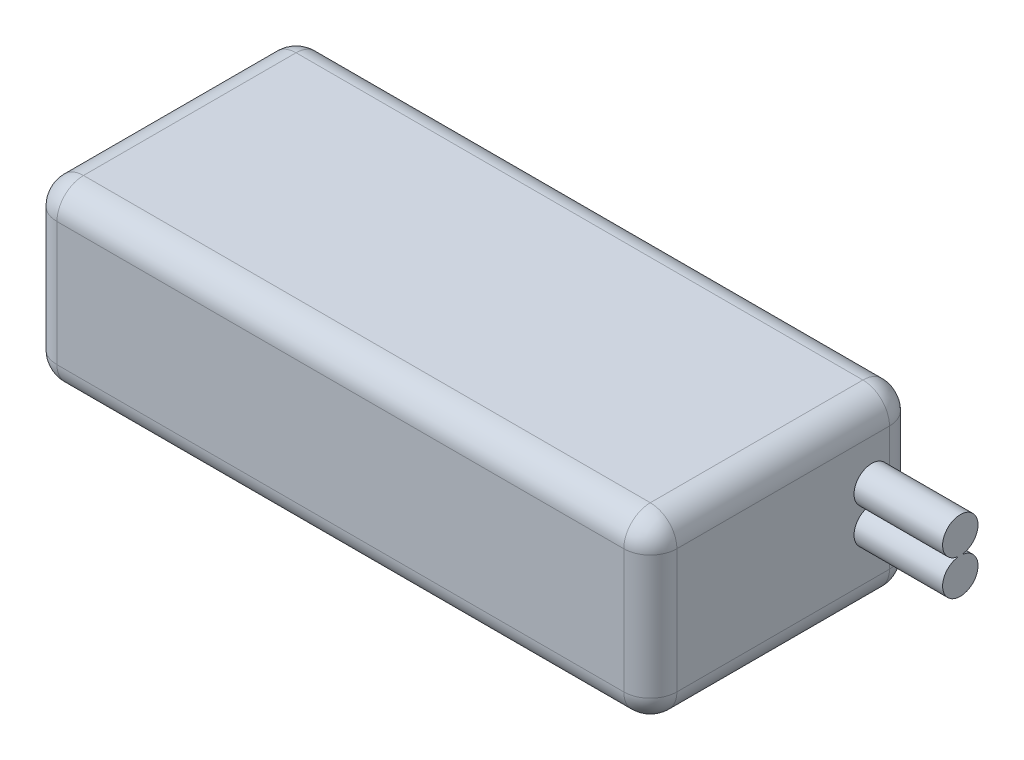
ISO-10303-21;
HEADER;
FILE_DESCRIPTION(('STEP AP214'),'2;1');
FILE_NAME('part.step','',(''),(''),'','','');
FILE_SCHEMA(('AUTOMOTIVE_DESIGN { 1 0 10303 214 1 1 1 1 }'));
ENDSEC;
DATA;
#1=APPLICATION_CONTEXT('core data for automotive mechanical design processes');
#2=APPLICATION_PROTOCOL_DEFINITION('international standard','automotive_design',2000,#1);
#3=PRODUCT_CONTEXT('',#1,'mechanical');
#4=PRODUCT('Part','Part','',(#3));
#5=PRODUCT_RELATED_PRODUCT_CATEGORY('part','',(#4));
#6=PRODUCT_DEFINITION_FORMATION('','',#4);
#7=PRODUCT_DEFINITION_CONTEXT('part definition',#1,'design');
#8=PRODUCT_DEFINITION('design','',#6,#7);
#9=PRODUCT_DEFINITION_SHAPE('','',#8);
#10=(LENGTH_UNIT() NAMED_UNIT(*) SI_UNIT(.MILLI.,.METRE.));
#11=(NAMED_UNIT(*) PLANE_ANGLE_UNIT() SI_UNIT($,.RADIAN.));
#12=(NAMED_UNIT(*) SI_UNIT($,.STERADIAN.) SOLID_ANGLE_UNIT());
#13=UNCERTAINTY_MEASURE_WITH_UNIT(LENGTH_MEASURE(1.E-05),#10,'distance_accuracy_value','');
#14=(GEOMETRIC_REPRESENTATION_CONTEXT(3) GLOBAL_UNCERTAINTY_ASSIGNED_CONTEXT((#13)) GLOBAL_UNIT_ASSIGNED_CONTEXT((#10,
#11,#12)) REPRESENTATION_CONTEXT('',''));
#15=CARTESIAN_POINT('',(0.,0.,0.));
#16=DIRECTION('',(0.,0.,1.));
#17=DIRECTION('',(1.,0.,0.));
#18=AXIS2_PLACEMENT_3D('',#15,#16,#17);
#19=CARTESIAN_POINT('',(70.,20.,0.));
#20=DIRECTION('',(-1.,0.,0.));
#21=DIRECTION('',(0.,0.,1.));
#22=AXIS2_PLACEMENT_3D('',#19,#20,#21);
#23=PLANE('',#22);
#24=CARTESIAN_POINT('',(70.,8.34085297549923,-25.));
#25=DIRECTION('',(1.,0.,0.));
#26=DIRECTION('',(0.,0.,-1.));
#27=AXIS2_PLACEMENT_3D('',#24,#25,#26);
#28=CIRCLE('',#27,2.);
#29=CARTESIAN_POINT('',(70.,10.3147545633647,-24.6779557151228));
#30=VERTEX_POINT('',#29);
#31=CARTESIAN_POINT('',(70.,8.34085297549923,-27.));
#32=VERTEX_POINT('',#31);
#33=EDGE_CURVE('E434',#30,#32,#28,.T.);
#34=ORIENTED_EDGE('',*,*,#33,.F.);
#35=DIRECTION('',(0.,-1.,0.));
#36=VECTOR('',#35,1.);
#37=CARTESIAN_POINT('',(70.,10.3669513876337,-24.6779557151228));
#38=LINE('',#37,#36);
#39=CARTESIAN_POINT('',(70.,10.3669513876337,-24.6779557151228));
#40=VERTEX_POINT('',#39);
#41=EDGE_CURVE('E187',#40,#30,#38,.T.);
#42=ORIENTED_EDGE('',*,*,#41,.F.);
#43=CARTESIAN_POINT('',(70.,12.3408529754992,-25.));
#44=DIRECTION('',(1.,0.,0.));
#45=DIRECTION('',(0.,0.,-1.));
#46=AXIS2_PLACEMENT_3D('',#43,#44,#45);
#47=CIRCLE('',#46,2.);
#48=CARTESIAN_POINT('',(70.,12.3408529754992,-27.));
#49=VERTEX_POINT('',#48);
#50=EDGE_CURVE('E414',#49,#40,#47,.T.);
#51=ORIENTED_EDGE('',*,*,#50,.F.);
#52=DIRECTION('',(0.,-1.,0.));
#53=VECTOR('',#52,1.);
#54=CARTESIAN_POINT('',(70.,20.,-27.));
#55=LINE('',#54,#53);
#56=CARTESIAN_POINT('',(70.,17.,-27.));
#57=VERTEX_POINT('',#56);
#58=EDGE_CURVE('E232',#49,#57,#55,.F.);
#59=ORIENTED_EDGE('',*,*,#58,.T.);
#60=DIRECTION('',(0.,0.,-1.));
#61=VECTOR('',#60,1.);
#62=CARTESIAN_POINT('',(70.,17.,0.));
#63=LINE('',#62,#61);
#64=CARTESIAN_POINT('',(70.,17.,-3.));
#65=VERTEX_POINT('',#64);
#66=EDGE_CURVE('E229',#57,#65,#63,.F.);
#67=ORIENTED_EDGE('',*,*,#66,.T.);
#68=DIRECTION('',(0.,-1.,0.));
#69=VECTOR('',#68,1.);
#70=CARTESIAN_POINT('',(70.,20.,-3.));
#71=LINE('',#70,#69);
#72=CARTESIAN_POINT('',(70.,3.,-3.));
#73=VERTEX_POINT('',#72);
#74=EDGE_CURVE('E241',#65,#73,#71,.T.);
#75=ORIENTED_EDGE('',*,*,#74,.T.);
#76=DIRECTION('',(0.,0.,-1.));
#77=VECTOR('',#76,1.);
#78=CARTESIAN_POINT('',(70.,3.,-30.));
#79=LINE('',#78,#77);
#80=CARTESIAN_POINT('',(70.,3.,-27.));
#81=VERTEX_POINT('',#80);
#82=EDGE_CURVE('E237',#73,#81,#79,.T.);
#83=ORIENTED_EDGE('',*,*,#82,.T.);
#84=EDGE_CURVE('E233',#81,#32,#55,.F.);
#85=ORIENTED_EDGE('',*,*,#84,.T.);
#86=EDGE_LOOP('',(#34,#42,#51,#59,#67,#75,#83,#85));
#87=FACE_BOUND('',#86,.T.);
#88=ADVANCED_FACE('F45',(#87),#23,.F.);
#89=CARTESIAN_POINT('',(70.,10.3147545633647,-25.3220442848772));
#90=VERTEX_POINT('',#89);
#91=EDGE_CURVE('E191',#32,#90,#28,.T.);
#92=ORIENTED_EDGE('',*,*,#91,.F.);
#93=EDGE_CURVE('E238',#32,#49,#55,.F.);
#94=ORIENTED_EDGE('',*,*,#93,.T.);
#95=CARTESIAN_POINT('',(70.,10.3669513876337,-25.3220442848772));
#96=VERTEX_POINT('',#95);
#97=EDGE_CURVE('E68',#96,#49,#47,.T.);
#98=ORIENTED_EDGE('',*,*,#97,.F.);
#99=DIRECTION('',(0.,1.,0.));
#100=VECTOR('',#99,1.);
#101=CARTESIAN_POINT('',(70.,10.3669513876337,-25.3220442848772));
#102=LINE('',#101,#100);
#103=EDGE_CURVE('E63',#90,#96,#102,.T.);
#104=ORIENTED_EDGE('',*,*,#103,.F.);
#105=EDGE_LOOP('',(#92,#94,#98,#104));
#106=FACE_BOUND('',#105,.T.);
#107=ADVANCED_FACE('F409',(#106),#23,.F.);
#108=CARTESIAN_POINT('',(0.,20.,0.));
#109=DIRECTION('',(1.,0.,0.));
#110=DIRECTION('',(0.,0.,-1.));
#111=AXIS2_PLACEMENT_3D('',#108,#109,#110);
#112=PLANE('',#111);
#113=DIRECTION('',(0.,-1.,0.));
#114=VECTOR('',#113,1.);
#115=CARTESIAN_POINT('',(0.,20.,-27.));
#116=LINE('',#115,#114);
#117=CARTESIAN_POINT('',(0.,17.,-27.));
#118=VERTEX_POINT('',#117);
#119=CARTESIAN_POINT('',(0.,3.,-27.));
#120=VERTEX_POINT('',#119);
#121=EDGE_CURVE('E219',#118,#120,#116,.T.);
#122=ORIENTED_EDGE('',*,*,#121,.T.);
#123=DIRECTION('',(0.,0.,1.));
#124=VECTOR('',#123,1.);
#125=CARTESIAN_POINT('',(0.,3.,0.));
#126=LINE('',#125,#124);
#127=CARTESIAN_POINT('',(0.,3.,-3.));
#128=VERTEX_POINT('',#127);
#129=EDGE_CURVE('E226',#120,#128,#126,.T.);
#130=ORIENTED_EDGE('',*,*,#129,.T.);
#131=DIRECTION('',(0.,-1.,0.));
#132=VECTOR('',#131,1.);
#133=CARTESIAN_POINT('',(0.,20.,-3.));
#134=LINE('',#133,#132);
#135=CARTESIAN_POINT('',(0.,17.,-3.));
#136=VERTEX_POINT('',#135);
#137=EDGE_CURVE('E222',#128,#136,#134,.F.);
#138=ORIENTED_EDGE('',*,*,#137,.T.);
#139=DIRECTION('',(0.,0.,1.));
#140=VECTOR('',#139,1.);
#141=CARTESIAN_POINT('',(0.,17.,0.));
#142=LINE('',#141,#140);
#143=EDGE_CURVE('E216',#136,#118,#142,.F.);
#144=ORIENTED_EDGE('',*,*,#143,.T.);
#145=EDGE_LOOP('',(#122,#130,#138,#144));
#146=FACE_BOUND('',#145,.T.);
#147=ADVANCED_FACE('F452',(#146),#112,.F.);
#148=CARTESIAN_POINT('',(0.,20.,0.));
#149=DIRECTION('',(0.,0.,-1.));
#150=DIRECTION('',(-1.,0.,0.));
#151=AXIS2_PLACEMENT_3D('',#148,#149,#150);
#152=PLANE('',#151);
#153=DIRECTION('',(0.,-1.,0.));
#154=VECTOR('',#153,1.);
#155=CARTESIAN_POINT('',(3.,20.,0.));
#156=LINE('',#155,#154);
#157=CARTESIAN_POINT('',(3.,17.,0.));
#158=VERTEX_POINT('',#157);
#159=CARTESIAN_POINT('',(3.,3.,0.));
#160=VERTEX_POINT('',#159);
#161=EDGE_CURVE('E209',#158,#160,#156,.T.);
#162=ORIENTED_EDGE('',*,*,#161,.T.);
#163=DIRECTION('',(1.,0.,0.));
#164=VECTOR('',#163,1.);
#165=CARTESIAN_POINT('',(70.,3.,0.));
#166=LINE('',#165,#164);
#167=CARTESIAN_POINT('',(67.,3.,0.));
#168=VERTEX_POINT('',#167);
#169=EDGE_CURVE('E213',#160,#168,#166,.T.);
#170=ORIENTED_EDGE('',*,*,#169,.T.);
#171=DIRECTION('',(0.,-1.,0.));
#172=VECTOR('',#171,1.);
#173=CARTESIAN_POINT('',(67.,20.,0.));
#174=LINE('',#173,#172);
#175=CARTESIAN_POINT('',(67.,17.,0.));
#176=VERTEX_POINT('',#175);
#177=EDGE_CURVE('E206',#168,#176,#174,.F.);
#178=ORIENTED_EDGE('',*,*,#177,.T.);
#179=DIRECTION('',(1.,0.,0.));
#180=VECTOR('',#179,1.);
#181=CARTESIAN_POINT('',(0.,17.,0.));
#182=LINE('',#181,#180);
#183=EDGE_CURVE('E203',#176,#158,#182,.F.);
#184=ORIENTED_EDGE('',*,*,#183,.T.);
#185=EDGE_LOOP('',(#162,#170,#178,#184));
#186=FACE_BOUND('',#185,.T.);
#187=ADVANCED_FACE('F457',(#186),#152,.F.);
#188=CARTESIAN_POINT('',(0.,20.,-30.));
#189=DIRECTION('',(0.,0.,1.));
#190=DIRECTION('',(1.,0.,0.));
#191=AXIS2_PLACEMENT_3D('',#188,#189,#190);
#192=PLANE('',#191);
#193=DIRECTION('',(-1.,0.,0.));
#194=VECTOR('',#193,1.);
#195=CARTESIAN_POINT('',(0.,17.,-30.));
#196=LINE('',#195,#194);
#197=CARTESIAN_POINT('',(2.99999999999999,17.,-30.));
#198=VERTEX_POINT('',#197);
#199=CARTESIAN_POINT('',(67.,17.,-30.));
#200=VERTEX_POINT('',#199);
#201=EDGE_CURVE('E258',#198,#200,#196,.F.);
#202=ORIENTED_EDGE('',*,*,#201,.T.);
#203=DIRECTION('',(0.,-1.,0.));
#204=VECTOR('',#203,1.);
#205=CARTESIAN_POINT('',(67.,20.,-30.));
#206=LINE('',#205,#204);
#207=CARTESIAN_POINT('',(67.,3.,-30.));
#208=VERTEX_POINT('',#207);
#209=EDGE_CURVE('E267',#200,#208,#206,.T.);
#210=ORIENTED_EDGE('',*,*,#209,.T.);
#211=DIRECTION('',(-1.,0.,0.));
#212=VECTOR('',#211,1.);
#213=CARTESIAN_POINT('',(0.,3.,-30.));
#214=LINE('',#213,#212);
#215=CARTESIAN_POINT('',(2.99999999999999,3.,-30.));
#216=VERTEX_POINT('',#215);
#217=EDGE_CURVE('E264',#208,#216,#214,.T.);
#218=ORIENTED_EDGE('',*,*,#217,.T.);
#219=DIRECTION('',(0.,-1.,0.));
#220=VECTOR('',#219,1.);
#221=CARTESIAN_POINT('',(2.99999999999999,20.,-30.));
#222=LINE('',#221,#220);
#223=EDGE_CURVE('E261',#216,#198,#222,.F.);
#224=ORIENTED_EDGE('',*,*,#223,.T.);
#225=EDGE_LOOP('',(#202,#210,#218,#224));
#226=FACE_BOUND('',#225,.T.);
#227=ADVANCED_FACE('F455',(#226),#192,.F.);
#228=CARTESIAN_POINT('',(0.,20.,0.));
#229=DIRECTION('',(0.,-1.,0.));
#230=DIRECTION('',(0.,0.,-1.));
#231=AXIS2_PLACEMENT_3D('',#228,#229,#230);
#232=PLANE('',#231);
#233=DIRECTION('',(-1.,0.,0.));
#234=VECTOR('',#233,1.);
#235=CARTESIAN_POINT('',(0.,20.,-27.));
#236=LINE('',#235,#234);
#237=CARTESIAN_POINT('',(67.,20.,-27.));
#238=VERTEX_POINT('',#237);
#239=CARTESIAN_POINT('',(2.99999999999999,20.,-27.));
#240=VERTEX_POINT('',#239);
#241=EDGE_CURVE('E55',#238,#240,#236,.T.);
#242=ORIENTED_EDGE('',*,*,#241,.T.);
#243=DIRECTION('',(0.,0.,1.));
#244=VECTOR('',#243,1.);
#245=CARTESIAN_POINT('',(3.,20.,0.));
#246=LINE('',#245,#244);
#247=CARTESIAN_POINT('',(3.,20.,-3.));
#248=VERTEX_POINT('',#247);
#249=EDGE_CURVE('E11',#240,#248,#246,.T.);
#250=ORIENTED_EDGE('',*,*,#249,.T.);
#251=DIRECTION('',(1.,0.,0.));
#252=VECTOR('',#251,1.);
#253=CARTESIAN_POINT('',(0.,20.,-3.));
#254=LINE('',#253,#252);
#255=CARTESIAN_POINT('',(67.,20.,-3.));
#256=VERTEX_POINT('',#255);
#257=EDGE_CURVE('E271',#248,#256,#254,.T.);
#258=ORIENTED_EDGE('',*,*,#257,.T.);
#259=DIRECTION('',(0.,0.,-1.));
#260=VECTOR('',#259,1.);
#261=CARTESIAN_POINT('',(67.,20.,0.));
#262=LINE('',#261,#260);
#263=EDGE_CURVE('E274',#256,#238,#262,.T.);
#264=ORIENTED_EDGE('',*,*,#263,.T.);
#265=EDGE_LOOP('',(#242,#250,#258,#264));
#266=FACE_BOUND('',#265,.T.);
#267=ADVANCED_FACE('F383',(#266),#232,.F.);
#268=CARTESIAN_POINT('',(0.,0.,0.));
#269=DIRECTION('',(0.,-1.,0.));
#270=DIRECTION('',(0.,0.,-1.));
#271=AXIS2_PLACEMENT_3D('',#268,#269,#270);
#272=PLANE('',#271);
#273=DIRECTION('',(0.,0.,-1.));
#274=VECTOR('',#273,1.);
#275=CARTESIAN_POINT('',(67.,0.,0.));
#276=LINE('',#275,#274);
#277=CARTESIAN_POINT('',(67.,0.,-27.));
#278=VERTEX_POINT('',#277);
#279=CARTESIAN_POINT('',(67.,0.,-3.));
#280=VERTEX_POINT('',#279);
#281=EDGE_CURVE('E251',#278,#280,#276,.F.);
#282=ORIENTED_EDGE('',*,*,#281,.T.);
#283=DIRECTION('',(1.,0.,0.));
#284=VECTOR('',#283,1.);
#285=CARTESIAN_POINT('',(0.,0.,-3.));
#286=LINE('',#285,#284);
#287=CARTESIAN_POINT('',(3.,0.,-3.));
#288=VERTEX_POINT('',#287);
#289=EDGE_CURVE('E254',#280,#288,#286,.F.);
#290=ORIENTED_EDGE('',*,*,#289,.T.);
#291=DIRECTION('',(0.,0.,1.));
#292=VECTOR('',#291,1.);
#293=CARTESIAN_POINT('',(2.99999999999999,0.,-30.));
#294=LINE('',#293,#292);
#295=CARTESIAN_POINT('',(2.99999999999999,0.,-27.));
#296=VERTEX_POINT('',#295);
#297=EDGE_CURVE('E245',#288,#296,#294,.F.);
#298=ORIENTED_EDGE('',*,*,#297,.T.);
#299=DIRECTION('',(-1.,0.,0.));
#300=VECTOR('',#299,1.);
#301=CARTESIAN_POINT('',(70.,0.,-27.));
#302=LINE('',#301,#300);
#303=EDGE_CURVE('E248',#296,#278,#302,.F.);
#304=ORIENTED_EDGE('',*,*,#303,.T.);
#305=EDGE_LOOP('',(#282,#290,#298,#304));
#306=FACE_BOUND('',#305,.T.);
#307=ADVANCED_FACE('F529',(#306),#272,.T.);
#308=CARTESIAN_POINT('',(67.,20.,-27.));
#309=DIRECTION('',(0.,-1.,0.));
#310=DIRECTION('',(0.,0.,-1.));
#311=AXIS2_PLACEMENT_3D('',#308,#309,#310);
#312=CYLINDRICAL_SURFACE('',#311,3.);
#313=CARTESIAN_POINT('',(67.,17.,-27.));
#314=DIRECTION('',(0.,1.,0.));
#315=DIRECTION('',(0.,0.,1.));
#316=AXIS2_PLACEMENT_3D('',#313,#314,#315);
#317=CIRCLE('',#316,3.);
#318=EDGE_CURVE('E49',#57,#200,#317,.T.);
#319=ORIENTED_EDGE('',*,*,#318,.F.);
#320=ORIENTED_EDGE('',*,*,#58,.F.);
#321=ORIENTED_EDGE('',*,*,#93,.F.);
#322=ORIENTED_EDGE('',*,*,#84,.F.);
#323=CARTESIAN_POINT('',(67.,3.,-27.));
#324=DIRECTION('',(0.,-1.,0.));
#325=DIRECTION('',(0.,0.,-1.));
#326=AXIS2_PLACEMENT_3D('',#323,#324,#325);
#327=CIRCLE('',#326,3.);
#328=EDGE_CURVE('E357',#208,#81,#327,.T.);
#329=ORIENTED_EDGE('',*,*,#328,.F.);
#330=ORIENTED_EDGE('',*,*,#209,.F.);
#331=EDGE_LOOP('',(#319,#320,#321,#322,#329,#330));
#332=FACE_BOUND('',#331,.T.);
#333=ADVANCED_FACE('F47',(#332),#312,.T.);
#334=CARTESIAN_POINT('',(67.,17.,-27.));
#335=DIRECTION('',(0.,0.,-1.));
#336=DIRECTION('',(-1.,0.,0.));
#337=AXIS2_PLACEMENT_3D('',#334,#335,#336);
#338=SPHERICAL_SURFACE('',#337,3.);
#339=CARTESIAN_POINT('',(67.,17.,-27.));
#340=DIRECTION('',(0.,0.,-1.));
#341=DIRECTION('',(-1.,0.,0.));
#342=AXIS2_PLACEMENT_3D('',#339,#340,#341);
#343=CIRCLE('',#342,3.);
#344=EDGE_CURVE('E350',#57,#238,#343,.F.);
#345=ORIENTED_EDGE('',*,*,#344,.F.);
#346=ORIENTED_EDGE('',*,*,#318,.T.);
#347=CARTESIAN_POINT('',(67.,17.,-27.));
#348=DIRECTION('',(1.,0.,0.));
#349=DIRECTION('',(0.,0.,-1.));
#350=AXIS2_PLACEMENT_3D('',#347,#348,#349);
#351=CIRCLE('',#350,3.);
#352=EDGE_CURVE('E354',#238,#200,#351,.F.);
#353=ORIENTED_EDGE('',*,*,#352,.F.);
#354=EDGE_LOOP('',(#345,#346,#353));
#355=FACE_BOUND('',#354,.T.);
#356=ADVANCED_FACE('F370',(#355),#338,.T.);
#357=CARTESIAN_POINT('',(67.,3.,-27.));
#358=DIRECTION('',(1.,0.,0.));
#359=DIRECTION('',(0.,1.,0.));
#360=AXIS2_PLACEMENT_3D('',#357,#358,#359);
#361=SPHERICAL_SURFACE('',#360,3.);
#362=CARTESIAN_POINT('',(67.,3.,-27.));
#363=DIRECTION('',(1.,0.,0.));
#364=DIRECTION('',(0.,0.,-1.));
#365=AXIS2_PLACEMENT_3D('',#362,#363,#364);
#366=CIRCLE('',#365,3.);
#367=EDGE_CURVE('E342',#208,#278,#366,.F.);
#368=ORIENTED_EDGE('',*,*,#367,.F.);
#369=ORIENTED_EDGE('',*,*,#328,.T.);
#370=CARTESIAN_POINT('',(67.,3.,-27.));
#371=DIRECTION('',(0.,0.,-1.));
#372=DIRECTION('',(-1.,0.,0.));
#373=AXIS2_PLACEMENT_3D('',#370,#371,#372);
#374=CIRCLE('',#373,3.);
#375=EDGE_CURVE('E346',#278,#81,#374,.F.);
#376=ORIENTED_EDGE('',*,*,#375,.F.);
#377=EDGE_LOOP('',(#368,#369,#376));
#378=FACE_BOUND('',#377,.T.);
#379=ADVANCED_FACE('F522',(#378),#361,.T.);
#380=CARTESIAN_POINT('',(0.,17.,-27.));
#381=DIRECTION('',(-1.,0.,0.));
#382=DIRECTION('',(0.,0.,1.));
#383=AXIS2_PLACEMENT_3D('',#380,#381,#382);
#384=CYLINDRICAL_SURFACE('',#383,3.);
#385=ORIENTED_EDGE('',*,*,#352,.T.);
#386=ORIENTED_EDGE('',*,*,#201,.F.);
#387=CARTESIAN_POINT('',(2.99999999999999,17.,-27.));
#388=DIRECTION('',(-1.,0.,0.));
#389=DIRECTION('',(0.,0.,1.));
#390=AXIS2_PLACEMENT_3D('',#387,#388,#389);
#391=CIRCLE('',#390,3.);
#392=EDGE_CURVE('E334',#240,#198,#391,.T.);
#393=ORIENTED_EDGE('',*,*,#392,.F.);
#394=ORIENTED_EDGE('',*,*,#241,.F.);
#395=EDGE_LOOP('',(#385,#386,#393,#394));
#396=FACE_BOUND('',#395,.T.);
#397=ADVANCED_FACE('F378',(#396),#384,.T.);
#398=CARTESIAN_POINT('',(67.,17.,0.));
#399=DIRECTION('',(0.,0.,-1.));
#400=DIRECTION('',(-1.,0.,0.));
#401=AXIS2_PLACEMENT_3D('',#398,#399,#400);
#402=CYLINDRICAL_SURFACE('',#401,3.);
#403=ORIENTED_EDGE('',*,*,#344,.T.);
#404=ORIENTED_EDGE('',*,*,#263,.F.);
#405=CARTESIAN_POINT('',(67.,17.,-3.));
#406=DIRECTION('',(0.,0.,1.));
#407=DIRECTION('',(1.,0.,0.));
#408=AXIS2_PLACEMENT_3D('',#405,#406,#407);
#409=CIRCLE('',#408,3.);
#410=EDGE_CURVE('E330',#65,#256,#409,.T.);
#411=ORIENTED_EDGE('',*,*,#410,.F.);
#412=ORIENTED_EDGE('',*,*,#66,.F.);
#413=EDGE_LOOP('',(#403,#404,#411,#412));
#414=FACE_BOUND('',#413,.T.);
#415=ADVANCED_FACE('F389',(#414),#402,.T.);
#416=CARTESIAN_POINT('',(67.,20.,-3.));
#417=DIRECTION('',(0.,-1.,0.));
#418=DIRECTION('',(0.,0.,-1.));
#419=AXIS2_PLACEMENT_3D('',#416,#417,#418);
#420=CYLINDRICAL_SURFACE('',#419,3.);
#421=CARTESIAN_POINT('',(67.,3.,-3.));
#422=DIRECTION('',(0.,-1.,0.));
#423=DIRECTION('',(0.,0.,-1.));
#424=AXIS2_PLACEMENT_3D('',#421,#422,#423);
#425=CIRCLE('',#424,3.);
#426=EDGE_CURVE('E322',#73,#168,#425,.T.);
#427=ORIENTED_EDGE('',*,*,#426,.F.);
#428=ORIENTED_EDGE('',*,*,#74,.F.);
#429=CARTESIAN_POINT('',(67.,17.,-3.));
#430=DIRECTION('',(0.,1.,0.));
#431=DIRECTION('',(0.,0.,1.));
#432=AXIS2_PLACEMENT_3D('',#429,#430,#431);
#433=CIRCLE('',#432,3.);
#434=EDGE_CURVE('E326',#176,#65,#433,.T.);
#435=ORIENTED_EDGE('',*,*,#434,.F.);
#436=ORIENTED_EDGE('',*,*,#177,.F.);
#437=EDGE_LOOP('',(#427,#428,#435,#436));
#438=FACE_BOUND('',#437,.T.);
#439=ADVANCED_FACE('F395',(#438),#420,.T.);
#440=CARTESIAN_POINT('',(67.,3.,0.));
#441=DIRECTION('',(0.,0.,1.));
#442=DIRECTION('',(1.,0.,0.));
#443=AXIS2_PLACEMENT_3D('',#440,#441,#442);
#444=CYLINDRICAL_SURFACE('',#443,3.);
#445=ORIENTED_EDGE('',*,*,#375,.T.);
#446=ORIENTED_EDGE('',*,*,#82,.F.);
#447=CARTESIAN_POINT('',(67.,3.,-3.));
#448=DIRECTION('',(0.,0.,1.));
#449=DIRECTION('',(1.,0.,0.));
#450=AXIS2_PLACEMENT_3D('',#447,#448,#449);
#451=CIRCLE('',#450,3.);
#452=EDGE_CURVE('E319',#280,#73,#451,.T.);
#453=ORIENTED_EDGE('',*,*,#452,.F.);
#454=ORIENTED_EDGE('',*,*,#281,.F.);
#455=EDGE_LOOP('',(#445,#446,#453,#454));
#456=FACE_BOUND('',#455,.T.);
#457=ADVANCED_FACE('F403',(#456),#444,.T.);
#458=CARTESIAN_POINT('',(0.,3.,-27.));
#459=DIRECTION('',(1.,0.,0.));
#460=DIRECTION('',(0.,0.,-1.));
#461=AXIS2_PLACEMENT_3D('',#458,#459,#460);
#462=CYLINDRICAL_SURFACE('',#461,3.);
#463=ORIENTED_EDGE('',*,*,#367,.T.);
#464=ORIENTED_EDGE('',*,*,#303,.F.);
#465=CARTESIAN_POINT('',(2.99999999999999,3.,-27.));
#466=DIRECTION('',(-1.,0.,0.));
#467=DIRECTION('',(0.,0.,1.));
#468=AXIS2_PLACEMENT_3D('',#465,#466,#467);
#469=CIRCLE('',#468,3.);
#470=EDGE_CURVE('E315',#216,#296,#469,.T.);
#471=ORIENTED_EDGE('',*,*,#470,.F.);
#472=ORIENTED_EDGE('',*,*,#217,.F.);
#473=EDGE_LOOP('',(#463,#464,#471,#472));
#474=FACE_BOUND('',#473,.T.);
#475=ADVANCED_FACE('F509',(#474),#462,.T.);
#476=CARTESIAN_POINT('',(2.99999999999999,20.,-27.));
#477=DIRECTION('',(0.,-1.,0.));
#478=DIRECTION('',(0.,0.,-1.));
#479=AXIS2_PLACEMENT_3D('',#476,#477,#478);
#480=CYLINDRICAL_SURFACE('',#479,3.);
#481=CARTESIAN_POINT('',(2.99999999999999,17.,-27.));
#482=DIRECTION('',(0.,1.,0.));
#483=DIRECTION('',(0.,0.,1.));
#484=AXIS2_PLACEMENT_3D('',#481,#482,#483);
#485=CIRCLE('',#484,3.);
#486=EDGE_CURVE('E338',#198,#118,#485,.T.);
#487=ORIENTED_EDGE('',*,*,#486,.F.);
#488=ORIENTED_EDGE('',*,*,#223,.F.);
#489=CARTESIAN_POINT('',(2.99999999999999,3.,-27.));
#490=DIRECTION('',(0.,-1.,0.));
#491=DIRECTION('',(0.,0.,-1.));
#492=AXIS2_PLACEMENT_3D('',#489,#490,#491);
#493=CIRCLE('',#492,3.);
#494=EDGE_CURVE('E311',#120,#216,#493,.T.);
#495=ORIENTED_EDGE('',*,*,#494,.F.);
#496=ORIENTED_EDGE('',*,*,#121,.F.);
#497=EDGE_LOOP('',(#487,#488,#495,#496));
#498=FACE_BOUND('',#497,.T.);
#499=ADVANCED_FACE('F505',(#498),#480,.T.);
#500=CARTESIAN_POINT('',(2.99999999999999,17.,-27.));
#501=DIRECTION('',(0.,0.,-1.));
#502=DIRECTION('',(-1.,0.,0.));
#503=AXIS2_PLACEMENT_3D('',#500,#501,#502);
#504=SPHERICAL_SURFACE('',#503,3.);
#505=ORIENTED_EDGE('',*,*,#392,.T.);
#506=ORIENTED_EDGE('',*,*,#486,.T.);
#507=CARTESIAN_POINT('',(2.99999999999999,17.,-27.));
#508=DIRECTION('',(0.,0.,-1.));
#509=DIRECTION('',(-1.,0.,0.));
#510=AXIS2_PLACEMENT_3D('',#507,#508,#509);
#511=CIRCLE('',#510,3.);
#512=EDGE_CURVE('E307',#240,#118,#511,.F.);
#513=ORIENTED_EDGE('',*,*,#512,.F.);
#514=EDGE_LOOP('',(#505,#506,#513));
#515=FACE_BOUND('',#514,.T.);
#516=ADVANCED_FACE('F501',(#515),#504,.T.);
#517=CARTESIAN_POINT('',(67.,17.,-3.));
#518=DIRECTION('',(1.,0.,0.));
#519=DIRECTION('',(0.,0.,-1.));
#520=AXIS2_PLACEMENT_3D('',#517,#518,#519);
#521=SPHERICAL_SURFACE('',#520,3.);
#522=ORIENTED_EDGE('',*,*,#434,.T.);
#523=ORIENTED_EDGE('',*,*,#410,.T.);
#524=CARTESIAN_POINT('',(67.,17.,-3.));
#525=DIRECTION('',(1.,0.,0.));
#526=DIRECTION('',(0.,0.,-1.));
#527=AXIS2_PLACEMENT_3D('',#524,#525,#526);
#528=CIRCLE('',#527,3.);
#529=EDGE_CURVE('E303',#176,#256,#528,.F.);
#530=ORIENTED_EDGE('',*,*,#529,.F.);
#531=EDGE_LOOP('',(#522,#523,#530));
#532=FACE_BOUND('',#531,.T.);
#533=ADVANCED_FACE('F498',(#532),#521,.T.);
#534=CARTESIAN_POINT('',(67.,3.,-3.));
#535=DIRECTION('',(1.,0.,0.));
#536=DIRECTION('',(0.,0.,-1.));
#537=AXIS2_PLACEMENT_3D('',#534,#535,#536);
#538=SPHERICAL_SURFACE('',#537,3.);
#539=ORIENTED_EDGE('',*,*,#452,.T.);
#540=ORIENTED_EDGE('',*,*,#426,.T.);
#541=CARTESIAN_POINT('',(67.,3.,-3.));
#542=DIRECTION('',(1.,0.,0.));
#543=DIRECTION('',(0.,0.,-1.));
#544=AXIS2_PLACEMENT_3D('',#541,#542,#543);
#545=CIRCLE('',#544,3.);
#546=EDGE_CURVE('E299',#280,#168,#545,.F.);
#547=ORIENTED_EDGE('',*,*,#546,.F.);
#548=EDGE_LOOP('',(#539,#540,#547));
#549=FACE_BOUND('',#548,.T.);
#550=ADVANCED_FACE('F494',(#549),#538,.T.);
#551=CARTESIAN_POINT('',(2.99999999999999,3.,-27.));
#552=DIRECTION('',(0.,0.,-1.));
#553=DIRECTION('',(0.,1.,0.));
#554=AXIS2_PLACEMENT_3D('',#551,#552,#553);
#555=SPHERICAL_SURFACE('',#554,3.);
#556=ORIENTED_EDGE('',*,*,#494,.T.);
#557=ORIENTED_EDGE('',*,*,#470,.T.);
#558=CARTESIAN_POINT('',(2.99999999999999,3.,-27.));
#559=DIRECTION('',(0.,0.,-1.));
#560=DIRECTION('',(-1.,0.,0.));
#561=AXIS2_PLACEMENT_3D('',#558,#559,#560);
#562=CIRCLE('',#561,3.);
#563=EDGE_CURVE('E295',#120,#296,#562,.F.);
#564=ORIENTED_EDGE('',*,*,#563,.F.);
#565=EDGE_LOOP('',(#556,#557,#564));
#566=FACE_BOUND('',#565,.T.);
#567=ADVANCED_FACE('F490',(#566),#555,.T.);
#568=CARTESIAN_POINT('',(3.,17.,0.));
#569=DIRECTION('',(0.,0.,1.));
#570=DIRECTION('',(1.,0.,0.));
#571=AXIS2_PLACEMENT_3D('',#568,#569,#570);
#572=CYLINDRICAL_SURFACE('',#571,3.);
#573=ORIENTED_EDGE('',*,*,#512,.T.);
#574=ORIENTED_EDGE('',*,*,#143,.F.);
#575=CARTESIAN_POINT('',(3.,17.,-3.));
#576=DIRECTION('',(0.,0.,1.));
#577=DIRECTION('',(1.,0.,0.));
#578=AXIS2_PLACEMENT_3D('',#575,#576,#577);
#579=CIRCLE('',#578,3.);
#580=EDGE_CURVE('E291',#248,#136,#579,.T.);
#581=ORIENTED_EDGE('',*,*,#580,.F.);
#582=ORIENTED_EDGE('',*,*,#249,.F.);
#583=EDGE_LOOP('',(#573,#574,#581,#582));
#584=FACE_BOUND('',#583,.T.);
#585=ADVANCED_FACE('F486',(#584),#572,.T.);
#586=CARTESIAN_POINT('',(0.,17.,-3.));
#587=DIRECTION('',(1.,0.,0.));
#588=DIRECTION('',(0.,0.,-1.));
#589=AXIS2_PLACEMENT_3D('',#586,#587,#588);
#590=CYLINDRICAL_SURFACE('',#589,3.);
#591=ORIENTED_EDGE('',*,*,#529,.T.);
#592=ORIENTED_EDGE('',*,*,#257,.F.);
#593=CARTESIAN_POINT('',(3.,17.,-3.));
#594=DIRECTION('',(-1.,0.,0.));
#595=DIRECTION('',(0.,0.,1.));
#596=AXIS2_PLACEMENT_3D('',#593,#594,#595);
#597=CIRCLE('',#596,3.);
#598=EDGE_CURVE('E288',#158,#248,#597,.T.);
#599=ORIENTED_EDGE('',*,*,#598,.F.);
#600=ORIENTED_EDGE('',*,*,#183,.F.);
#601=EDGE_LOOP('',(#591,#592,#599,#600));
#602=FACE_BOUND('',#601,.T.);
#603=ADVANCED_FACE('F482',(#602),#590,.T.);
#604=CARTESIAN_POINT('',(0.,3.,-3.));
#605=DIRECTION('',(-1.,0.,0.));
#606=DIRECTION('',(0.,0.,1.));
#607=AXIS2_PLACEMENT_3D('',#604,#605,#606);
#608=CYLINDRICAL_SURFACE('',#607,3.);
#609=ORIENTED_EDGE('',*,*,#546,.T.);
#610=ORIENTED_EDGE('',*,*,#169,.F.);
#611=CARTESIAN_POINT('',(3.,3.,-3.));
#612=DIRECTION('',(-1.,0.,0.));
#613=DIRECTION('',(0.,0.,1.));
#614=AXIS2_PLACEMENT_3D('',#611,#612,#613);
#615=CIRCLE('',#614,3.);
#616=EDGE_CURVE('E284',#288,#160,#615,.T.);
#617=ORIENTED_EDGE('',*,*,#616,.F.);
#618=ORIENTED_EDGE('',*,*,#289,.F.);
#619=EDGE_LOOP('',(#609,#610,#617,#618));
#620=FACE_BOUND('',#619,.T.);
#621=ADVANCED_FACE('F478',(#620),#608,.T.);
#622=CARTESIAN_POINT('',(3.,3.,0.));
#623=DIRECTION('',(0.,0.,-1.));
#624=DIRECTION('',(-1.,0.,0.));
#625=AXIS2_PLACEMENT_3D('',#622,#623,#624);
#626=CYLINDRICAL_SURFACE('',#625,3.);
#627=ORIENTED_EDGE('',*,*,#563,.T.);
#628=ORIENTED_EDGE('',*,*,#297,.F.);
#629=CARTESIAN_POINT('',(3.,3.,-3.));
#630=DIRECTION('',(0.,0.,1.));
#631=DIRECTION('',(1.,0.,0.));
#632=AXIS2_PLACEMENT_3D('',#629,#630,#631);
#633=CIRCLE('',#632,3.);
#634=EDGE_CURVE('E281',#128,#288,#633,.T.);
#635=ORIENTED_EDGE('',*,*,#634,.F.);
#636=ORIENTED_EDGE('',*,*,#129,.F.);
#637=EDGE_LOOP('',(#627,#628,#635,#636));
#638=FACE_BOUND('',#637,.T.);
#639=ADVANCED_FACE('F474',(#638),#626,.T.);
#640=CARTESIAN_POINT('',(3.,17.,-3.));
#641=DIRECTION('',(0.,1.,0.));
#642=DIRECTION('',(0.,0.,1.));
#643=AXIS2_PLACEMENT_3D('',#640,#641,#642);
#644=SPHERICAL_SURFACE('',#643,3.);
#645=ORIENTED_EDGE('',*,*,#598,.T.);
#646=ORIENTED_EDGE('',*,*,#580,.T.);
#647=CARTESIAN_POINT('',(3.,17.,-3.));
#648=DIRECTION('',(0.,1.,0.));
#649=DIRECTION('',(0.,0.,1.));
#650=AXIS2_PLACEMENT_3D('',#647,#648,#649);
#651=CIRCLE('',#650,3.);
#652=EDGE_CURVE('E197',#158,#136,#651,.F.);
#653=ORIENTED_EDGE('',*,*,#652,.F.);
#654=EDGE_LOOP('',(#645,#646,#653));
#655=FACE_BOUND('',#654,.T.);
#656=ADVANCED_FACE('F470',(#655),#644,.T.);
#657=CARTESIAN_POINT('',(3.,3.,-3.));
#658=DIRECTION('',(0.,-1.,0.));
#659=DIRECTION('',(0.,0.,-1.));
#660=AXIS2_PLACEMENT_3D('',#657,#658,#659);
#661=SPHERICAL_SURFACE('',#660,3.);
#662=ORIENTED_EDGE('',*,*,#634,.T.);
#663=ORIENTED_EDGE('',*,*,#616,.T.);
#664=CARTESIAN_POINT('',(3.,3.,-3.));
#665=DIRECTION('',(0.,-1.,0.));
#666=DIRECTION('',(0.,0.,-1.));
#667=AXIS2_PLACEMENT_3D('',#664,#665,#666);
#668=CIRCLE('',#667,3.);
#669=EDGE_CURVE('E193',#128,#160,#668,.F.);
#670=ORIENTED_EDGE('',*,*,#669,.F.);
#671=EDGE_LOOP('',(#662,#663,#670));
#672=FACE_BOUND('',#671,.T.);
#673=ADVANCED_FACE('F466',(#672),#661,.T.);
#674=CARTESIAN_POINT('',(3.,20.,-3.));
#675=DIRECTION('',(0.,-1.,0.));
#676=DIRECTION('',(0.,0.,-1.));
#677=AXIS2_PLACEMENT_3D('',#674,#675,#676);
#678=CYLINDRICAL_SURFACE('',#677,3.);
#679=ORIENTED_EDGE('',*,*,#652,.T.);
#680=ORIENTED_EDGE('',*,*,#137,.F.);
#681=ORIENTED_EDGE('',*,*,#669,.T.);
#682=ORIENTED_EDGE('',*,*,#161,.F.);
#683=EDGE_LOOP('',(#679,#680,#681,#682));
#684=FACE_BOUND('',#683,.T.);
#685=ADVANCED_FACE('F464',(#684),#678,.T.);
#686=CARTESIAN_POINT('',(80.,8.34085297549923,-25.));
#687=DIRECTION('',(-1.,0.,0.));
#688=DIRECTION('',(0.,0.,1.));
#689=AXIS2_PLACEMENT_3D('',#686,#687,#688);
#690=CYLINDRICAL_SURFACE('',#689,2.);
#691=ORIENTED_EDGE('',*,*,#33,.T.);
#692=ORIENTED_EDGE('',*,*,#91,.T.);
#693=DIRECTION('',(-1.,0.,0.));
#694=VECTOR('',#693,1.);
#695=CARTESIAN_POINT('',(80.,10.3147545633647,-25.3220442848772));
#696=LINE('',#695,#694);
#697=CARTESIAN_POINT('',(80.,10.3147545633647,-25.3220442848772));
#698=VERTEX_POINT('',#697);
#699=EDGE_CURVE('E170',#698,#90,#696,.T.);
#700=ORIENTED_EDGE('',*,*,#699,.F.);
#701=CARTESIAN_POINT('',(80.,8.34085297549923,-25.));
#702=DIRECTION('',(1.,0.,0.));
#703=DIRECTION('',(0.,0.,-1.));
#704=AXIS2_PLACEMENT_3D('',#701,#702,#703);
#705=CIRCLE('',#704,2.);
#706=CARTESIAN_POINT('',(80.,10.3147545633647,-24.6779557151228));
#707=VERTEX_POINT('',#706);
#708=EDGE_CURVE('E177',#707,#698,#705,.T.);
#709=ORIENTED_EDGE('',*,*,#708,.F.);
#710=DIRECTION('',(-1.,0.,0.));
#711=VECTOR('',#710,1.);
#712=CARTESIAN_POINT('',(80.,10.3147545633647,-24.6779557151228));
#713=LINE('',#712,#711);
#714=EDGE_CURVE('E425',#707,#30,#713,.T.);
#715=ORIENTED_EDGE('',*,*,#714,.T.);
#716=EDGE_LOOP('',(#691,#692,#700,#709,#715));
#717=FACE_BOUND('',#716,.T.);
#718=ADVANCED_FACE('F190',(#717),#690,.T.);
#719=CARTESIAN_POINT('',(80.,10.3669513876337,-25.3220442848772));
#720=DIRECTION('',(0.,0.,1.));
#721=DIRECTION('',(1.,0.,0.));
#722=AXIS2_PLACEMENT_3D('',#719,#720,#721);
#723=PLANE('',#722);
#724=ORIENTED_EDGE('',*,*,#103,.T.);
#725=DIRECTION('',(-1.,0.,0.));
#726=VECTOR('',#725,1.);
#727=CARTESIAN_POINT('',(80.,10.3669513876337,-25.3220442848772));
#728=LINE('',#727,#726);
#729=CARTESIAN_POINT('',(80.,10.3669513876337,-25.3220442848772));
#730=VERTEX_POINT('',#729);
#731=EDGE_CURVE('E172',#730,#96,#728,.T.);
#732=ORIENTED_EDGE('',*,*,#731,.F.);
#733=DIRECTION('',(0.,1.,0.));
#734=VECTOR('',#733,1.);
#735=CARTESIAN_POINT('',(80.,10.3669513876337,-25.3220442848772));
#736=LINE('',#735,#734);
#737=EDGE_CURVE('E166',#698,#730,#736,.T.);
#738=ORIENTED_EDGE('',*,*,#737,.F.);
#739=ORIENTED_EDGE('',*,*,#699,.T.);
#740=EDGE_LOOP('',(#724,#732,#738,#739));
#741=FACE_BOUND('',#740,.T.);
#742=ADVANCED_FACE('F168',(#741),#723,.F.);
#743=CARTESIAN_POINT('',(80.,12.3408529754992,-25.));
#744=DIRECTION('',(-1.,0.,0.));
#745=DIRECTION('',(0.,0.,1.));
#746=AXIS2_PLACEMENT_3D('',#743,#744,#745);
#747=CYLINDRICAL_SURFACE('',#746,2.);
#748=ORIENTED_EDGE('',*,*,#97,.T.);
#749=ORIENTED_EDGE('',*,*,#50,.T.);
#750=DIRECTION('',(-1.,0.,0.));
#751=VECTOR('',#750,1.);
#752=CARTESIAN_POINT('',(80.,10.3669513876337,-24.6779557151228));
#753=LINE('',#752,#751);
#754=CARTESIAN_POINT('',(80.,10.3669513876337,-24.6779557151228));
#755=VERTEX_POINT('',#754);
#756=EDGE_CURVE('E199',#755,#40,#753,.T.);
#757=ORIENTED_EDGE('',*,*,#756,.F.);
#758=CARTESIAN_POINT('',(80.,12.3408529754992,-25.));
#759=DIRECTION('',(1.,0.,0.));
#760=DIRECTION('',(0.,0.,-1.));
#761=AXIS2_PLACEMENT_3D('',#758,#759,#760);
#762=CIRCLE('',#761,2.);
#763=EDGE_CURVE('E176',#730,#755,#762,.T.);
#764=ORIENTED_EDGE('',*,*,#763,.F.);
#765=ORIENTED_EDGE('',*,*,#731,.T.);
#766=EDGE_LOOP('',(#748,#749,#757,#764,#765));
#767=FACE_BOUND('',#766,.T.);
#768=ADVANCED_FACE('F412',(#767),#747,.T.);
#769=CARTESIAN_POINT('',(80.,10.3669513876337,-24.6779557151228));
#770=DIRECTION('',(0.,0.,-1.));
#771=DIRECTION('',(-1.,0.,0.));
#772=AXIS2_PLACEMENT_3D('',#769,#770,#771);
#773=PLANE('',#772);
#774=ORIENTED_EDGE('',*,*,#41,.T.);
#775=ORIENTED_EDGE('',*,*,#714,.F.);
#776=DIRECTION('',(0.,-1.,0.));
#777=VECTOR('',#776,1.);
#778=CARTESIAN_POINT('',(80.,10.3669513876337,-24.6779557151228));
#779=LINE('',#778,#777);
#780=EDGE_CURVE('E182',#755,#707,#779,.T.);
#781=ORIENTED_EDGE('',*,*,#780,.F.);
#782=ORIENTED_EDGE('',*,*,#756,.T.);
#783=EDGE_LOOP('',(#774,#775,#781,#782));
#784=FACE_BOUND('',#783,.T.);
#785=ADVANCED_FACE('F429',(#784),#773,.F.);
#786=CARTESIAN_POINT('',(80.,8.34085297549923,-25.));
#787=DIRECTION('',(1.,0.,0.));
#788=DIRECTION('',(0.,0.,-1.));
#789=AXIS2_PLACEMENT_3D('',#786,#787,#788);
#790=PLANE('',#789);
#791=ORIENTED_EDGE('',*,*,#708,.T.);
#792=ORIENTED_EDGE('',*,*,#737,.T.);
#793=ORIENTED_EDGE('',*,*,#763,.T.);
#794=ORIENTED_EDGE('',*,*,#780,.T.);
#795=EDGE_LOOP('',(#791,#792,#793,#794));
#796=FACE_BOUND('',#795,.T.);
#797=ADVANCED_FACE('F180',(#796),#790,.T.);
#798=CLOSED_SHELL('',(#88,#107,#147,#187,#227,#267,#307,#333,#356,#379,#397,#415,#439,#457,#475,
#499,#516,#533,#550,#567,#585,#603,#621,#639,#656,#673,#685,#718,#742,#768,#785,#797));
#799=MANIFOLD_SOLID_BREP('B2',#798);
#800=ADVANCED_BREP_SHAPE_REPRESENTATION('',(#18,#799),#14);
#801=SHAPE_DEFINITION_REPRESENTATION(#9,#800);
ENDSEC;
END-ISO-10303-21;
